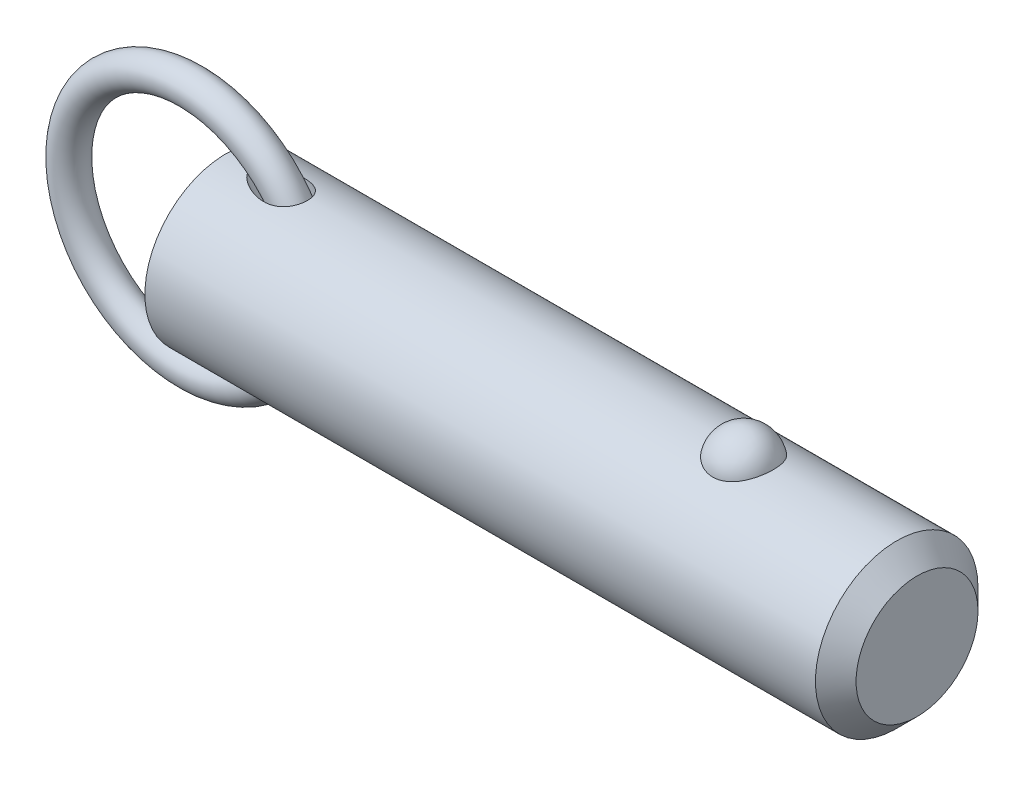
ISO-10303-21;
HEADER;
FILE_DESCRIPTION(('STEP AP214'),'2;1');
FILE_NAME('part.step','',(''),(''),'','','');
FILE_SCHEMA(('AUTOMOTIVE_DESIGN { 1 0 10303 214 1 1 1 1 }'));
ENDSEC;
DATA;
#1=APPLICATION_CONTEXT('core data for automotive mechanical design processes');
#2=APPLICATION_PROTOCOL_DEFINITION('international standard','automotive_design',2000,#1);
#3=PRODUCT_CONTEXT('',#1,'mechanical');
#4=PRODUCT('Part','Part','',(#3));
#5=PRODUCT_RELATED_PRODUCT_CATEGORY('part','',(#4));
#6=PRODUCT_DEFINITION_FORMATION('','',#4);
#7=PRODUCT_DEFINITION_CONTEXT('part definition',#1,'design');
#8=PRODUCT_DEFINITION('design','',#6,#7);
#9=PRODUCT_DEFINITION_SHAPE('','',#8);
#10=(LENGTH_UNIT() NAMED_UNIT(*) SI_UNIT(.MILLI.,.METRE.));
#11=(NAMED_UNIT(*) PLANE_ANGLE_UNIT() SI_UNIT($,.RADIAN.));
#12=(NAMED_UNIT(*) SI_UNIT($,.STERADIAN.) SOLID_ANGLE_UNIT());
#13=UNCERTAINTY_MEASURE_WITH_UNIT(LENGTH_MEASURE(1.E-05),#10,'distance_accuracy_value','');
#14=(GEOMETRIC_REPRESENTATION_CONTEXT(3) GLOBAL_UNCERTAINTY_ASSIGNED_CONTEXT((#13)) GLOBAL_UNIT_ASSIGNED_CONTEXT((#10,
#11,#12)) REPRESENTATION_CONTEXT('',''));
#15=CARTESIAN_POINT('',(0.,0.,0.));
#16=DIRECTION('',(0.,0.,1.));
#17=DIRECTION('',(1.,0.,0.));
#18=AXIS2_PLACEMENT_3D('',#15,#16,#17);
#19=CARTESIAN_POINT('',(-5.53898640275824,0.,0.));
#20=DIRECTION('',(0.,0.,1.));
#21=DIRECTION('',(1.,0.,0.));
#22=AXIS2_PLACEMENT_3D('',#19,#20,#21);
#23=TOROIDAL_SURFACE('',#22,19.05,2.54);
#24=CARTESIAN_POINT('',(16.0510135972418,0.,0.));
#25=VERTEX_POINT('',#24);
#26=VERTEX_LOOP('',#25);
#27=FACE_BOUND('',#26,.T.);
#28=ADVANCED_FACE('P0_F12',(#27),#23,.T.);
#29=CLOSED_SHELL('',(#28));
#30=MANIFOLD_SOLID_BREP('P0_B1',#29);
#31=CARTESIAN_POINT('',(0.,0.,0.));
#32=DIRECTION('',(1.,0.,0.));
#33=DIRECTION('',(0.,0.,-1.));
#34=AXIS2_PLACEMENT_3D('',#31,#32,#33);
#35=CYLINDRICAL_SURFACE('',#34,12.7);
#36=CARTESIAN_POINT('',(104.775,0.,0.));
#37=DIRECTION('',(1.,0.,0.));
#38=DIRECTION('',(0.,0.,-1.));
#39=AXIS2_PLACEMENT_3D('',#36,#37,#38);
#40=CIRCLE('',#39,12.7);
#41=CARTESIAN_POINT('',(104.775,0.,-12.7));
#42=VERTEX_POINT('',#41);
#43=EDGE_CURVE('P1_E89',#42,#42,#40,.T.);
#44=ORIENTED_EDGE('',*,*,#43,.F.);
#45=EDGE_LOOP('',(#44));
#46=FACE_BOUND('',#45,.T.);
#47=CARTESIAN_POINT('',(0.,0.,0.));
#48=DIRECTION('',(1.,0.,0.));
#49=DIRECTION('',(0.,0.,-1.));
#50=AXIS2_PLACEMENT_3D('',#47,#48,#49);
#51=CIRCLE('',#50,12.7);
#52=CARTESIAN_POINT('',(0.,0.,-12.7));
#53=VERTEX_POINT('',#52);
#54=EDGE_CURVE('P1_E52',#53,#53,#51,.T.);
#55=ORIENTED_EDGE('',*,*,#54,.T.);
#56=EDGE_LOOP('',(#55));
#57=FACE_BOUND('',#56,.T.);
#58=CARTESIAN_POINT('',(80.8600429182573,11.7500437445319,4.81938502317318));
#59=CARTESIAN_POINT('',(80.7350881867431,11.7500430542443,4.81938571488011));
#60=CARTESIAN_POINT('',(80.610144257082,11.7520975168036,4.81438658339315));
#61=CARTESIAN_POINT('',(80.3611425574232,11.760253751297,4.79442904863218));
#62=CARTESIAN_POINT('',(80.2370850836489,11.7663568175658,4.77946746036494));
#63=CARTESIAN_POINT('',(79.9909016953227,11.7824262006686,4.73971414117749));
#64=CARTESIAN_POINT('',(79.8687744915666,11.7923898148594,4.71492928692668));
#65=CARTESIAN_POINT('',(79.6271874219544,11.8158938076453,4.65571340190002));
#66=CARTESIAN_POINT('',(79.5077285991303,11.8294355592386,4.6212786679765));
#67=CARTESIAN_POINT('',(79.2725578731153,11.8596812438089,4.54309502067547));
#68=CARTESIAN_POINT('',(79.1568393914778,11.8763792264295,4.49936361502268));
#69=CARTESIAN_POINT('',(78.9296530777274,11.9124878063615,4.40287235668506));
#70=CARTESIAN_POINT('',(78.8181868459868,11.9318994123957,4.35010914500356));
#71=CARTESIAN_POINT('',(78.4912782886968,11.9934256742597,4.17881316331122));
#72=CARTESIAN_POINT('',(78.2831270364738,12.038858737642,4.04720756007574));
#73=CARTESIAN_POINT('',(77.8858509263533,12.1352173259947,3.748564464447));
#74=CARTESIAN_POINT('',(77.6974438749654,12.1862630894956,3.58061821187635));
#75=CARTESIAN_POINT('',(77.3505213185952,12.2875163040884,3.21600758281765));
#76=CARTESIAN_POINT('',(77.1920113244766,12.3377235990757,3.0193379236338));
#77=CARTESIAN_POINT('',(76.9016887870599,12.4344923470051,2.592916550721));
#78=CARTESIAN_POINT('',(76.7713762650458,12.4807925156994,2.36208286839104));
#79=CARTESIAN_POINT('',(76.5494079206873,12.5623454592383,1.88070399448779));
#80=CARTESIAN_POINT('',(76.4577554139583,12.5975972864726,1.63015711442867));
#81=CARTESIAN_POINT('',(76.3140466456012,12.6538414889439,1.1129886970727));
#82=CARTESIAN_POINT('',(76.2624990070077,12.6746503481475,0.846205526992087));
#83=CARTESIAN_POINT('',(76.2019771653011,12.699153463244,0.307085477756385));
#84=CARTESIAN_POINT('',(76.1930018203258,12.7028481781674,0.0347487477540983));
#85=CARTESIAN_POINT('',(76.2177310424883,12.6927785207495,-0.506073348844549));
#86=CARTESIAN_POINT('',(76.2511899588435,12.6791146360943,-0.774571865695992));
#87=CARTESIAN_POINT('',(76.3596877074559,12.635882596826,-1.30170246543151));
#88=CARTESIAN_POINT('',(76.4347272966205,12.606314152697,-1.5603343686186));
#89=CARTESIAN_POINT('',(76.6250000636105,12.5342328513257,-2.06083899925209));
#90=CARTESIAN_POINT('',(76.7402872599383,12.4917026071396,-2.3026886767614));
#91=CARTESIAN_POINT('',(77.0087044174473,12.3981123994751,-2.76259600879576));
#92=CARTESIAN_POINT('',(77.1618374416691,12.3470517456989,-2.98065173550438));
#93=CARTESIAN_POINT('',(77.5035077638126,12.2416045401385,-3.38786328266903));
#94=CARTESIAN_POINT('',(77.6922017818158,12.1872040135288,-3.57688418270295));
#95=CARTESIAN_POINT('',(78.1002392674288,12.0814086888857,-3.91941073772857));
#96=CARTESIAN_POINT('',(78.3195800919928,12.0300136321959,-4.07291945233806));
#97=CARTESIAN_POINT('',(78.7783753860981,11.9373542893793,-4.33691289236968));
#98=CARTESIAN_POINT('',(79.0173044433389,11.8958982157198,-4.44824125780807));
#99=CARTESIAN_POINT('',(79.5124376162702,11.8268116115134,-4.62881985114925));
#100=CARTESIAN_POINT('',(79.7686351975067,11.7991758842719,-4.69808589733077));
#101=CARTESIAN_POINT('',(80.2771640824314,11.7622209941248,-4.78983181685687));
#102=CARTESIAN_POINT('',(80.5290414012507,11.7520502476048,-4.81449025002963));
#103=CARTESIAN_POINT('',(81.0335734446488,11.7485796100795,-4.82295735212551));
#104=CARTESIAN_POINT('',(81.2862280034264,11.7552763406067,-4.80677420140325));
#105=CARTESIAN_POINT('',(81.7768341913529,11.7842584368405,-4.73525430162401));
#106=CARTESIAN_POINT('',(82.0149984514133,11.8060486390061,-4.6811606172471));
#107=CARTESIAN_POINT('',(82.4784894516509,11.8622750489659,-4.53678133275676));
#108=CARTESIAN_POINT('',(82.7038151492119,11.8967122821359,-4.44649279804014));
#109=CARTESIAN_POINT('',(83.1408018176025,11.9754603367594,-4.2298761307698));
#110=CARTESIAN_POINT('',(83.3520579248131,12.0199699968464,-4.10280539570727));
#111=CARTESIAN_POINT('',(83.7506012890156,12.1138028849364,-3.81685409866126));
#112=CARTESIAN_POINT('',(83.9378830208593,12.163127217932,-3.65796622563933));
#113=CARTESIAN_POINT('',(84.2933509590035,12.2642343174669,-3.30364864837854));
#114=CARTESIAN_POINT('',(84.4601119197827,12.3160165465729,-3.10678783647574));
#115=CARTESIAN_POINT('',(84.7595799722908,12.4142566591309,-2.68748409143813));
#116=CARTESIAN_POINT('',(84.8922809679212,12.4607135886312,-2.46503658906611));
#117=CARTESIAN_POINT('',(85.1246912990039,12.5450236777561,-1.9928951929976));
#118=CARTESIAN_POINT('',(85.223215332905,12.5825557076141,-1.74255918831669));
#119=CARTESIAN_POINT('',(85.3792277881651,12.6431720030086,-1.22773734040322));
#120=CARTESIAN_POINT('',(85.4367157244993,12.6662560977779,-0.963251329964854));
#121=CARTESIAN_POINT('',(85.5095441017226,12.6956486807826,-0.427355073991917));
#122=CARTESIAN_POINT('',(85.5248378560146,12.7019385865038,-0.155937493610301));
#123=CARTESIAN_POINT('',(85.5127794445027,12.6970201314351,0.385928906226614));
#124=CARTESIAN_POINT('',(85.4854280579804,12.6858120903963,0.656377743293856));
#125=CARTESIAN_POINT('',(85.4130609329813,12.6568455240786,1.05454017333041));
#126=CARTESIAN_POINT('',(85.3837963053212,12.6451962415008,1.18577850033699));
#127=CARTESIAN_POINT('',(85.3150228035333,12.6181819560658,1.44513808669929));
#128=CARTESIAN_POINT('',(85.2755176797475,12.6028183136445,1.57326046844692));
#129=CARTESIAN_POINT('',(85.1864397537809,12.5687547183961,1.82554978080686));
#130=CARTESIAN_POINT('',(85.1368627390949,12.5500533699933,1.9497150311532));
#131=CARTESIAN_POINT('',(85.0279211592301,12.5098093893,2.19314370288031));
#132=CARTESIAN_POINT('',(84.9685601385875,12.4882677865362,2.31240887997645));
#133=CARTESIAN_POINT('',(84.8399712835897,12.4427679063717,2.54593031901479));
#134=CARTESIAN_POINT('',(84.7706888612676,12.4187964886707,2.66015396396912));
#135=CARTESIAN_POINT('',(84.622903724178,12.3691892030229,2.88202659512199));
#136=CARTESIAN_POINT('',(84.5444044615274,12.3435539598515,2.98967802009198));
#137=CARTESIAN_POINT('',(84.3785502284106,12.2912955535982,3.19774385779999));
#138=CARTESIAN_POINT('',(84.2911918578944,12.2646720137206,3.298155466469));
#139=CARTESIAN_POINT('',(84.1081617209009,12.2111945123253,3.49095035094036));
#140=CARTESIAN_POINT('',(84.0124932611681,12.1843406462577,3.58333679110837));
#141=CARTESIAN_POINT('',(83.8136272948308,12.1312249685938,3.75922876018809));
#142=CARTESIAN_POINT('',(83.7104503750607,12.104961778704,3.84275713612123));
#143=CARTESIAN_POINT('',(83.4970133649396,12.0537284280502,4.00056406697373));
#144=CARTESIAN_POINT('',(83.3867562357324,12.028757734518,4.07484645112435));
#145=CARTESIAN_POINT('',(83.1597550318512,11.9808306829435,4.21367959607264));
#146=CARTESIAN_POINT('',(83.0430068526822,11.9578756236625,4.27822410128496));
#147=CARTESIAN_POINT('',(82.8039425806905,11.9147184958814,4.39698483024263));
#148=CARTESIAN_POINT('',(82.6816287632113,11.894515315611,4.45120522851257));
#149=CARTESIAN_POINT('',(82.422952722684,11.8561129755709,4.55255353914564));
#150=CARTESIAN_POINT('',(82.2862237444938,11.8381764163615,4.59884858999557));
#151=CARTESIAN_POINT('',(82.0086087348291,11.8069093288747,4.67853897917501));
#152=CARTESIAN_POINT('',(81.8677245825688,11.7935767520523,4.71194005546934));
#153=CARTESIAN_POINT('',(81.5830944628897,11.7720277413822,4.76552188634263));
#154=CARTESIAN_POINT('',(81.4393488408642,11.7638106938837,4.78570422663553));
#155=CARTESIAN_POINT('',(81.1504114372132,11.7528195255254,4.81263433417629));
#156=CARTESIAN_POINT('',(81.0052198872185,11.7500445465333,4.81938421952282));
#157=CARTESIAN_POINT('',(80.8600429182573,11.7500437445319,4.81938502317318));
#158=B_SPLINE_CURVE_WITH_KNOTS('',3,(#58,#59,#60,#61,#62,#63,#64,#65,#66,#67,#68,#69,#70,#71,
#72,#73,#74,#75,#76,#77,#78,#79,#80,#81,#82,#83,#84,#85,#86,#87,#88,#89,#90,#91,#92,#93,#94,#95,
#96,#97,#98,#99,#100,#101,#102,#103,#104,#105,#106,#107,#108,#109,#110,#111,#112,#113,#114,#115,
#116,#117,#118,#119,#120,#121,#122,#123,#124,#125,#126,#127,#128,#129,#130,#131,#132,#133,#134,
#135,#136,#137,#138,#139,#140,#141,#142,#143,#144,#145,#146,#147,#148,#149,#150,#151,#152,#153,
#154,#155,#156,#157),.UNSPECIFIED.,.T.,.F.,(4,2,2,2,2,2,2,2,2,2,2,2,2,2,2,2,2,2,2,2,2,2,2,2,2,2,
2,2,2,2,2,2,2,2,2,2,2,2,2,2,2,2,2,2,2,2,2,2,2,4),(0.,0.374729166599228,0.749578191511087,
1.12416526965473,1.49889629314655,1.87292776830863,2.24709865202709,2.99481328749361,
3.76399449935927,4.53331735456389,5.33683915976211,6.14042986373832,6.95405296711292,
7.76765424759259,8.57656703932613,9.38549455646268,10.1955119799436,11.0055949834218,
11.8193353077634,12.6330054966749,13.4294141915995,14.2255231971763,14.9815786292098,
15.7374826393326,16.4696948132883,17.2019663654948,17.9501979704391,18.6986017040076,
19.484470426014,20.2704797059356,21.0815215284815,21.8925729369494,22.7045213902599,
23.5164550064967,23.9209608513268,24.3253187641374,24.7298461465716,25.1342272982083,
25.54092555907,25.9474719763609,26.3541750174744,26.7607169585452,27.1661834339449,
27.5714814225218,27.9770386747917,28.3824315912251,28.8181206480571,29.2536155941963,
29.6890582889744,30.1244323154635),.UNSPECIFIED.);
#159=CARTESIAN_POINT('',(80.8600429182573,11.7500437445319,4.81938502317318));
#160=VERTEX_POINT('',#159);
#161=EDGE_CURVE('P1_E80',#160,#160,#158,.T.);
#162=ORIENTED_EDGE('',*,*,#161,.T.);
#163=EDGE_LOOP('',(#162));
#164=FACE_BOUND('',#163,.T.);
#165=CARTESIAN_POINT('',(-5.53898640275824,0.,0.));
#166=DIRECTION('',(0.796400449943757,-0.604769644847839,0.));
#167=DIRECTION('',(0.604769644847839,0.796400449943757,0.));
#168=AXIS2_PLACEMENT_3D('',#165,#166,#167);
#169=ELLIPSE('',#168,15.9467514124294,12.7);
#170=CARTESIAN_POINT('',(4.09482149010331,12.6864319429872,0.586893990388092));
#171=VERTEX_POINT('',#170);
#172=CARTESIAN_POINT('',(4.09482149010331,12.6864319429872,-0.586893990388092));
#173=VERTEX_POINT('',#172);
#174=EDGE_CURVE('P1_E47',#171,#173,#169,.F.);
#175=ORIENTED_EDGE('',*,*,#174,.T.);
#176=CARTESIAN_POINT('',(4.06153170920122,12.6905758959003,-0.48916605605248));
#177=CARTESIAN_POINT('',(4.08111374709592,12.6881366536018,-0.552489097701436));
#178=CARTESIAN_POINT('',(4.10417851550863,12.6852663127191,-0.614604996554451));
#179=CARTESIAN_POINT('',(4.1562843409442,12.6787965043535,-0.736067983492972));
#180=CARTESIAN_POINT('',(4.18531032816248,12.6751988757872,-0.795421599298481));
#181=CARTESIAN_POINT('',(4.27911159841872,12.6636052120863,-0.967590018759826));
#182=CARTESIAN_POINT('',(4.35123408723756,12.654730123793,-1.07635920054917));
#183=CARTESIAN_POINT('',(4.49106800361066,12.6376715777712,-1.25922957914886));
#184=CARTESIAN_POINT('',(4.5560106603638,12.6297947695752,-1.33556751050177));
#185=CARTESIAN_POINT('',(4.69223626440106,12.6134116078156,-1.48232741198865));
#186=CARTESIAN_POINT('',(4.7635214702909,12.6049050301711,-1.55274725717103));
#187=CARTESIAN_POINT('',(4.91163946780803,12.587417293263,-1.68868704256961));
#188=CARTESIAN_POINT('',(4.98851399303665,12.5784327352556,-1.75416062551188));
#189=CARTESIAN_POINT('',(5.14630057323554,12.560235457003,-1.88003275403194));
#190=CARTESIAN_POINT('',(5.22721398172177,12.5510226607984,-1.94042957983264));
#191=CARTESIAN_POINT('',(5.45368877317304,12.5256514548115,-2.09966332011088));
#192=CARTESIAN_POINT('',(5.60261616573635,12.5094182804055,-2.19371988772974));
#193=CARTESIAN_POINT('',(5.90795545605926,12.4774211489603,-2.36893890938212));
#194=CARTESIAN_POINT('',(6.06437232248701,12.4616575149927,-2.45009264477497));
#195=CARTESIAN_POINT('',(6.38306132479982,12.431227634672,-2.60008249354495));
#196=CARTESIAN_POINT('',(6.54533237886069,12.4165611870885,-2.66892086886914));
#197=CARTESIAN_POINT('',(6.87462618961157,12.3889351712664,-2.79435199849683));
#198=CARTESIAN_POINT('',(7.0416477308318,12.3759751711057,-2.85094785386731));
#199=CARTESIAN_POINT('',(7.38726647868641,12.3518460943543,-2.95377962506));
#200=CARTESIAN_POINT('',(7.56604577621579,12.3407843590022,-2.9994320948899));
#201=CARTESIAN_POINT('',(7.92698692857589,12.3219309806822,-3.07596683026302));
#202=CARTESIAN_POINT('',(8.10914972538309,12.314140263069,-3.1068449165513));
#203=CARTESIAN_POINT('',(8.47511457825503,12.3025918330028,-3.15226850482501));
#204=CARTESIAN_POINT('',(8.6589097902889,12.2988216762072,-3.16686440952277));
#205=CARTESIAN_POINT('',(9.02696087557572,12.2959421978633,-3.17802250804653));
#206=CARTESIAN_POINT('',(9.21121628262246,12.2968292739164,-3.17459864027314));
#207=CARTESIAN_POINT('',(9.61636263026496,12.3045198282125,-3.14471110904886));
#208=CARTESIAN_POINT('',(9.83695552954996,12.3125080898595,-3.1136323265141));
#209=CARTESIAN_POINT('',(10.1619126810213,12.3303028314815,-3.04206574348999));
#210=CARTESIAN_POINT('',(10.2692747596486,12.3372061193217,-3.01403983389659));
#211=CARTESIAN_POINT('',(10.4811758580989,12.3528538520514,-2.94925947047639));
#212=CARTESIAN_POINT('',(10.5857162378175,12.361597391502,-2.91250930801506));
#213=CARTESIAN_POINT('',(10.7921321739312,12.3808585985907,-2.82951748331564));
#214=CARTESIAN_POINT('',(10.8939665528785,12.3913944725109,-2.78317723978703));
#215=CARTESIAN_POINT('',(11.0926118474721,12.4138762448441,-2.68112002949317));
#216=CARTESIAN_POINT('',(11.1894254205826,12.4258213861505,-2.62540809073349));
#217=CARTESIAN_POINT('',(11.3768740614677,12.4507225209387,-2.50465655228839));
#218=CARTESIAN_POINT('',(11.46751150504,12.4636781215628,-2.43962056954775));
#219=CARTESIAN_POINT('',(11.641457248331,12.4901070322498,-2.30048560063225));
#220=CARTESIAN_POINT('',(11.7247669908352,12.5035802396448,-2.2263884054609));
#221=CARTESIAN_POINT('',(11.8713131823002,12.5285000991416,-2.08117367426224));
#222=CARTESIAN_POINT('',(11.9357009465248,12.5399538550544,-2.0112159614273));
#223=CARTESIAN_POINT('',(12.0576805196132,12.5624496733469,-1.86555293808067));
#224=CARTESIAN_POINT('',(12.1152732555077,12.5734917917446,-1.7898484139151));
#225=CARTESIAN_POINT('',(12.2230738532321,12.5947858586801,-1.63327883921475));
#226=CARTESIAN_POINT('',(12.2732844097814,12.6050380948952,-1.55241568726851));
#227=CARTESIAN_POINT('',(12.3658430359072,12.6243983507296,-1.38621267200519));
#228=CARTESIAN_POINT('',(12.4081916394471,12.6335064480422,-1.30087311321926));
#229=CARTESIAN_POINT('',(12.5150098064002,12.6569076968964,-1.05702619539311));
#230=CARTESIAN_POINT('',(12.5703399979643,12.6695746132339,-0.894232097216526));
#231=CARTESIAN_POINT('',(12.6526225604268,12.6886816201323,-0.561391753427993));
#232=CARTESIAN_POINT('',(12.6795825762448,12.6951233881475,-0.391347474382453));
#233=CARTESIAN_POINT('',(12.7041016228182,12.7009766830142,-0.0537636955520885));
#234=CARTESIAN_POINT('',(12.7024538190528,12.7005778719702,0.113714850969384));
#235=CARTESIAN_POINT('',(12.6717240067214,12.6932548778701,0.445979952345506));
#236=CARTESIAN_POINT('',(12.6426435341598,12.6863310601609,0.61076665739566));
#237=CARTESIAN_POINT('',(12.5579769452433,12.6667465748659,0.932429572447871));
#238=CARTESIAN_POINT('',(12.5024793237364,12.6541050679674,1.08933027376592));
#239=CARTESIAN_POINT('',(12.3665691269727,12.6244558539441,1.39146752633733));
#240=CARTESIAN_POINT('',(12.2861577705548,12.6074483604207,1.53670464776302));
#241=CARTESIAN_POINT('',(12.1018203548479,12.5706804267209,1.81319588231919));
#242=CARTESIAN_POINT('',(11.9976588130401,12.5508932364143,1.94428915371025));
#243=CARTESIAN_POINT('',(11.7695265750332,12.5107540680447,2.18776051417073));
#244=CARTESIAN_POINT('',(11.6455540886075,12.4904020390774,2.30013691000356));
#245=CARTESIAN_POINT('',(11.3759347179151,12.4502278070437,2.50870972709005));
#246=CARTESIAN_POINT('',(11.2295880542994,12.4304654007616,2.60400962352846));
#247=CARTESIAN_POINT('',(10.9239803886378,12.3941696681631,2.7716292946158));
#248=CARTESIAN_POINT('',(10.7647152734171,12.3776373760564,2.84394171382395));
#249=CARTESIAN_POINT('',(10.4192039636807,12.3473062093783,2.9730352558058));
#250=CARTESIAN_POINT('',(10.231933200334,12.3340204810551,3.02717164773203));
#251=CARTESIAN_POINT('',(9.85152982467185,12.3134301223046,3.10986173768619));
#252=CARTESIAN_POINT('',(9.65839336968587,12.3061295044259,3.13839827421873));
#253=CARTESIAN_POINT('',(9.31022514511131,12.2982822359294,3.16897517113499));
#254=CARTESIAN_POINT('',(9.15555718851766,12.2966525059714,3.1752689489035));
#255=CARTESIAN_POINT('',(8.84618945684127,12.2967963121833,3.17471335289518));
#256=CARTESIAN_POINT('',(8.69148970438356,12.2985715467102,3.16785742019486));
#257=CARTESIAN_POINT('',(8.38280471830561,12.3051648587,3.14214692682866));
#258=CARTESIAN_POINT('',(8.22882218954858,12.3099904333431,3.12326280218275));
#259=CARTESIAN_POINT('',(7.92276070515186,12.3222644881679,3.07448013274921));
#260=CARTESIAN_POINT('',(7.77068148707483,12.3297126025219,3.04458312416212));
#261=CARTESIAN_POINT('',(7.46452663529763,12.3470493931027,2.97350781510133));
#262=CARTESIAN_POINT('',(7.31052714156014,12.3570043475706,2.93201910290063));
#263=CARTESIAN_POINT('',(7.00579083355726,12.3787609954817,2.83876185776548));
#264=CARTESIAN_POINT('',(6.85505451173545,12.3905629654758,2.78699178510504));
#265=CARTESIAN_POINT('',(6.55781208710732,12.415528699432,2.6735774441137));
#266=CARTESIAN_POINT('',(6.41129783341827,12.4286895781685,2.61195394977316));
#267=CARTESIAN_POINT('',(6.12302950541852,12.4559398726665,2.47874512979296));
#268=CARTESIAN_POINT('',(5.981273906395,12.4700289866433,2.40716303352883));
#269=CARTESIAN_POINT('',(5.6707312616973,12.5020754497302,2.2355042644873));
#270=CARTESIAN_POINT('',(5.50343839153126,12.5201625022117,2.13268685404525));
#271=CARTESIAN_POINT('',(5.26147616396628,12.5471537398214,1.96522579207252));
#272=CARTESIAN_POINT('',(5.18224299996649,12.5561365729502,1.90713440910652));
#273=CARTESIAN_POINT('',(5.02746475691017,12.573912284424,1.78618989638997));
#274=CARTESIAN_POINT('',(4.95191912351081,12.5827051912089,1.72333748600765));
#275=CARTESIAN_POINT('',(4.81787163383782,12.598469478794,1.60360864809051));
#276=CARTESIAN_POINT('',(4.75865966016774,12.6054958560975,1.54753994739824));
#277=CARTESIAN_POINT('',(4.64406285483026,12.6191906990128,1.43158546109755));
#278=CARTESIAN_POINT('',(4.5886792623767,12.6258590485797,1.37169845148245));
#279=CARTESIAN_POINT('',(4.43014912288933,12.6450546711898,1.18656670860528));
#280=CARTESIAN_POINT('',(4.3337272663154,12.6568788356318,1.05507993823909));
#281=CARTESIAN_POINT('',(4.21252055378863,12.6718304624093,0.848052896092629));
#282=CARTESIAN_POINT('',(4.17660155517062,12.6762773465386,0.779100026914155));
#283=CARTESIAN_POINT('',(4.11264979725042,12.6842122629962,0.637080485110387));
#284=CARTESIAN_POINT('',(4.08466792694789,12.6876941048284,0.563990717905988));
#285=CARTESIAN_POINT('',(4.06153170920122,12.6905758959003,0.4891660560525));
#286=B_SPLINE_CURVE_WITH_KNOTS('',3,(#176,#177,#178,#179,#180,#181,#182,#183,#184,#185,#186,
#187,#188,#189,#190,#191,#192,#193,#194,#195,#196,#197,#198,#199,#200,#201,#202,#203,#204,#205,
#206,#207,#208,#209,#210,#211,#212,#213,#214,#215,#216,#217,#218,#219,#220,#221,#222,#223,#224,
#225,#226,#227,#228,#229,#230,#231,#232,#233,#234,#235,#236,#237,#238,#239,#240,#241,#242,#243,
#244,#245,#246,#247,#248,#249,#250,#251,#252,#253,#254,#255,#256,#257,#258,#259,#260,#261,#262,
#263,#264,#265,#266,#267,#268,#269,#270,#271,#272,#273,#274,#275,#276,#277,#278,#279,#280,#281,
#282,#283,#284,#285),.UNSPECIFIED.,.F.,.F.,(4,2,2,2,2,2,2,2,2,2,2,2,2,2,2,2,2,2,2,2,2,2,2,2,2,2,
2,2,2,2,2,2,2,2,2,2,2,2,2,2,2,2,2,2,2,2,2,2,2,2,2,2,2,2,4),(0.,0.198708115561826,
0.39691995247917,0.787580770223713,1.08882492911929,1.39017679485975,1.69407136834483,
1.99806847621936,2.52793143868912,3.05815092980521,3.58827293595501,4.11826050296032,
4.67218806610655,5.22627222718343,5.77863637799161,6.3305733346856,6.99657211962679,
7.32977411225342,7.66281254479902,7.99946156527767,8.33593054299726,8.67226935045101,
9.00854178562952,9.29544181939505,9.58230266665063,9.86905853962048,10.1557949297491,
10.6702338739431,11.1845341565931,11.6845985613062,12.1846349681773,12.6830079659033,
13.1813565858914,13.68487951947,14.1884479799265,14.713533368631,15.2387866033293,
15.8228373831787,16.407279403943,16.8710810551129,17.3351141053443,17.8002921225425,
18.2654052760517,18.7444169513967,19.2235004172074,19.7015868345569,20.1795185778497,
20.7699825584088,21.0658110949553,21.3615950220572,21.606957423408,21.8523988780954,
22.3397467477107,22.5729183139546,22.8075527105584),.UNSPECIFIED.);
#287=EDGE_CURVE('P1_E51',#173,#171,#286,.T.);
#288=ORIENTED_EDGE('',*,*,#287,.T.);
#289=EDGE_LOOP('',(#175,#288));
#290=FACE_BOUND('',#289,.T.);
#291=CARTESIAN_POINT('',(-5.53898640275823,0.,0.));
#292=DIRECTION('',(-0.796400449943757,-0.604769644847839,0.));
#293=DIRECTION('',(0.604769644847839,-0.796400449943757,0.));
#294=AXIS2_PLACEMENT_3D('',#291,#292,#293);
#295=ELLIPSE('',#294,15.9467514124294,12.7);
#296=CARTESIAN_POINT('',(4.09482149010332,-12.6864319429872,0.586893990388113));
#297=VERTEX_POINT('',#296);
#298=CARTESIAN_POINT('',(4.09482149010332,-12.6864319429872,-0.586893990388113));
#299=VERTEX_POINT('',#298);
#300=EDGE_CURVE('P1_E28',#297,#299,#295,.F.);
#301=ORIENTED_EDGE('',*,*,#300,.F.);
#302=CARTESIAN_POINT('',(4.06153170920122,-12.6905758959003,0.489166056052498));
#303=CARTESIAN_POINT('',(4.08111374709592,-12.6881366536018,0.552489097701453));
#304=CARTESIAN_POINT('',(4.10417851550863,-12.6852663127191,0.614604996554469));
#305=CARTESIAN_POINT('',(4.15628434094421,-12.6787965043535,0.736067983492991));
#306=CARTESIAN_POINT('',(4.18531032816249,-12.6751988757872,0.795421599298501));
#307=CARTESIAN_POINT('',(4.27911159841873,-12.6636052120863,0.967590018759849));
#308=CARTESIAN_POINT('',(4.35123408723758,-12.654730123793,1.07635920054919));
#309=CARTESIAN_POINT('',(4.49106800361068,-12.6376715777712,1.25922957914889));
#310=CARTESIAN_POINT('',(4.55601066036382,-12.6297947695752,1.3355675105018));
#311=CARTESIAN_POINT('',(4.69223626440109,-12.6134116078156,1.48232741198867));
#312=CARTESIAN_POINT('',(4.76352147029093,-12.6049050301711,1.55274725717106));
#313=CARTESIAN_POINT('',(4.91163946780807,-12.587417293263,1.68868704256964));
#314=CARTESIAN_POINT('',(4.98851399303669,-12.5784327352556,1.75416062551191));
#315=CARTESIAN_POINT('',(5.14630057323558,-12.560235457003,1.88003275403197));
#316=CARTESIAN_POINT('',(5.22721398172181,-12.5510226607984,1.94042957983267));
#317=CARTESIAN_POINT('',(5.45368877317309,-12.5256514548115,2.09966332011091));
#318=CARTESIAN_POINT('',(5.60261616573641,-12.5094182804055,2.19371988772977));
#319=CARTESIAN_POINT('',(5.90795545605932,-12.4774211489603,2.36893890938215));
#320=CARTESIAN_POINT('',(6.06437232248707,-12.4616575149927,2.450092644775));
#321=CARTESIAN_POINT('',(6.38306132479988,-12.431227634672,2.60008249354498));
#322=CARTESIAN_POINT('',(6.54533237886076,-12.4165611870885,2.66892086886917));
#323=CARTESIAN_POINT('',(6.87462618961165,-12.3889351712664,2.79435199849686));
#324=CARTESIAN_POINT('',(7.04164773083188,-12.3759751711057,2.85094785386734));
#325=CARTESIAN_POINT('',(7.38726647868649,-12.3518460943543,2.95377962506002));
#326=CARTESIAN_POINT('',(7.56604577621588,-12.3407843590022,2.99943209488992));
#327=CARTESIAN_POINT('',(7.92698692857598,-12.3219309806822,3.07596683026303));
#328=CARTESIAN_POINT('',(8.10914972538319,-12.314140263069,3.10684491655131));
#329=CARTESIAN_POINT('',(8.47511457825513,-12.3025918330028,3.15226850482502));
#330=CARTESIAN_POINT('',(8.65890979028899,-12.2988216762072,3.16686440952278));
#331=CARTESIAN_POINT('',(9.02696087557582,-12.2959421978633,3.17802250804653));
#332=CARTESIAN_POINT('',(9.21121628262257,-12.2968292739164,3.17459864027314));
#333=CARTESIAN_POINT('',(9.61636263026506,-12.3045198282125,3.14471110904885));
#334=CARTESIAN_POINT('',(9.83695552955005,-12.3125080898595,3.11363232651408));
#335=CARTESIAN_POINT('',(10.1619126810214,-12.3303028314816,3.04206574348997));
#336=CARTESIAN_POINT('',(10.2692747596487,-12.3372061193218,3.01403983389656));
#337=CARTESIAN_POINT('',(10.481175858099,-12.3528538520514,2.94925947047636));
#338=CARTESIAN_POINT('',(10.5857162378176,-12.361597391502,2.91250930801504));
#339=CARTESIAN_POINT('',(10.7921321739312,-12.3808585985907,2.82951748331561));
#340=CARTESIAN_POINT('',(10.8939665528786,-12.3913944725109,2.78317723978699));
#341=CARTESIAN_POINT('',(11.0926118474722,-12.4138762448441,2.68112002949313));
#342=CARTESIAN_POINT('',(11.1894254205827,-12.4258213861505,2.62540809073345));
#343=CARTESIAN_POINT('',(11.3768740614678,-12.4507225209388,2.50465655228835));
#344=CARTESIAN_POINT('',(11.4675115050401,-12.4636781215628,2.4396205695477));
#345=CARTESIAN_POINT('',(11.641457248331,-12.4901070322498,2.3004856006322));
#346=CARTESIAN_POINT('',(11.7247669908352,-12.5035802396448,2.22638840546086));
#347=CARTESIAN_POINT('',(11.8713131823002,-12.5285000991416,2.0811736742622));
#348=CARTESIAN_POINT('',(11.9357009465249,-12.5399538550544,2.01121596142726));
#349=CARTESIAN_POINT('',(12.0576805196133,-12.5624496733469,1.86555293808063));
#350=CARTESIAN_POINT('',(12.1152732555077,-12.5734917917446,1.78984841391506));
#351=CARTESIAN_POINT('',(12.2230738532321,-12.5947858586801,1.63327883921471));
#352=CARTESIAN_POINT('',(12.2732844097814,-12.6050380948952,1.55241568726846));
#353=CARTESIAN_POINT('',(12.3658430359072,-12.6243983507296,1.38621267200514));
#354=CARTESIAN_POINT('',(12.4081916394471,-12.6335064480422,1.30087311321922));
#355=CARTESIAN_POINT('',(12.5150098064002,-12.6569076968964,1.05702619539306));
#356=CARTESIAN_POINT('',(12.5703399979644,-12.6695746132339,0.89423209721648));
#357=CARTESIAN_POINT('',(12.6526225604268,-12.6886816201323,0.561391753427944));
#358=CARTESIAN_POINT('',(12.6795825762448,-12.6951233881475,0.391347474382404));
#359=CARTESIAN_POINT('',(12.7041016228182,-12.7009766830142,0.0537636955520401));
#360=CARTESIAN_POINT('',(12.7024538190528,-12.7005778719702,-0.113714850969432));
#361=CARTESIAN_POINT('',(12.6717240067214,-12.6932548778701,-0.445979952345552));
#362=CARTESIAN_POINT('',(12.6426435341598,-12.6863310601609,-0.610766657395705));
#363=CARTESIAN_POINT('',(12.5579769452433,-12.6667465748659,-0.932429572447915));
#364=CARTESIAN_POINT('',(12.5024793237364,-12.6541050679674,-1.08933027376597));
#365=CARTESIAN_POINT('',(12.3665691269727,-12.6244558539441,-1.39146752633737));
#366=CARTESIAN_POINT('',(12.2861577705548,-12.6074483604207,-1.53670464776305));
#367=CARTESIAN_POINT('',(12.1018203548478,-12.5706804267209,-1.81319588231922));
#368=CARTESIAN_POINT('',(11.99765881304,-12.5508932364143,-1.94428915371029));
#369=CARTESIAN_POINT('',(11.7695265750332,-12.5107540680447,-2.18776051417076));
#370=CARTESIAN_POINT('',(11.6455540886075,-12.4904020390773,-2.30013691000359));
#371=CARTESIAN_POINT('',(11.375934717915,-12.4502278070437,-2.50870972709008));
#372=CARTESIAN_POINT('',(11.2295880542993,-12.4304654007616,-2.60400962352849));
#373=CARTESIAN_POINT('',(10.9239803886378,-12.3941696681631,-2.77162929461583));
#374=CARTESIAN_POINT('',(10.764715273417,-12.3776373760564,-2.84394171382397));
#375=CARTESIAN_POINT('',(10.4192039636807,-12.3473062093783,-2.97303525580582));
#376=CARTESIAN_POINT('',(10.2319332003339,-12.3340204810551,-3.02717164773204));
#377=CARTESIAN_POINT('',(9.8515298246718,-12.3134301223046,-3.1098617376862));
#378=CARTESIAN_POINT('',(9.65839336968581,-12.3061295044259,-3.13839827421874));
#379=CARTESIAN_POINT('',(9.31022514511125,-12.2982822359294,-3.168975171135));
#380=CARTESIAN_POINT('',(9.1555571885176,-12.2966525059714,-3.1752689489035));
#381=CARTESIAN_POINT('',(8.84618945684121,-12.2967963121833,-3.17471335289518));
#382=CARTESIAN_POINT('',(8.6914897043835,-12.2985715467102,-3.16785742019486));
#383=CARTESIAN_POINT('',(8.38280471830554,-12.3051648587,-3.14214692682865));
#384=CARTESIAN_POINT('',(8.22882218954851,-12.3099904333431,-3.12326280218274));
#385=CARTESIAN_POINT('',(7.92276070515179,-12.3222644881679,-3.07448013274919));
#386=CARTESIAN_POINT('',(7.77068148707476,-12.329712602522,-3.04458312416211));
#387=CARTESIAN_POINT('',(7.46452663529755,-12.3470493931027,-2.97350781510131));
#388=CARTESIAN_POINT('',(7.31052714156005,-12.3570043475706,-2.93201910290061));
#389=CARTESIAN_POINT('',(7.00579083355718,-12.3787609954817,-2.83876185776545));
#390=CARTESIAN_POINT('',(6.85505451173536,-12.3905629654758,-2.78699178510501));
#391=CARTESIAN_POINT('',(6.55781208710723,-12.415528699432,-2.67357744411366));
#392=CARTESIAN_POINT('',(6.41129783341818,-12.4286895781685,-2.61195394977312));
#393=CARTESIAN_POINT('',(6.12302950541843,-12.4559398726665,-2.47874512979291));
#394=CARTESIAN_POINT('',(5.9812739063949,-12.4700289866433,-2.40716303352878));
#395=CARTESIAN_POINT('',(5.6707312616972,-12.5020754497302,-2.23550426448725));
#396=CARTESIAN_POINT('',(5.50343839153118,-12.5201625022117,-2.13268685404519));
#397=CARTESIAN_POINT('',(5.2614761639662,-12.5471537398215,-1.96522579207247));
#398=CARTESIAN_POINT('',(5.18224299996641,-12.5561365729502,-1.90713440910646));
#399=CARTESIAN_POINT('',(5.0274647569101,-12.573912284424,-1.78618989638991));
#400=CARTESIAN_POINT('',(4.95191912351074,-12.5827051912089,-1.7233374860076));
#401=CARTESIAN_POINT('',(4.81787163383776,-12.598469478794,-1.60360864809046));
#402=CARTESIAN_POINT('',(4.75865966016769,-12.6054958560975,-1.54753994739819));
#403=CARTESIAN_POINT('',(4.64406285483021,-12.6191906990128,-1.43158546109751));
#404=CARTESIAN_POINT('',(4.58867926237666,-12.6258590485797,-1.37169845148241));
#405=CARTESIAN_POINT('',(4.43014912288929,-12.6450546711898,-1.18656670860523));
#406=CARTESIAN_POINT('',(4.33372726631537,-12.6568788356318,-1.05507993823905));
#407=CARTESIAN_POINT('',(4.2125205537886,-12.6718304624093,-0.848052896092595));
#408=CARTESIAN_POINT('',(4.17660155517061,-12.6762773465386,-0.779100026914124));
#409=CARTESIAN_POINT('',(4.11264979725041,-12.6842122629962,-0.637080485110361));
#410=CARTESIAN_POINT('',(4.08466792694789,-12.6876941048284,-0.563990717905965));
#411=CARTESIAN_POINT('',(4.06153170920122,-12.6905758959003,-0.489166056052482));
#412=B_SPLINE_CURVE_WITH_KNOTS('',3,(#302,#303,#304,#305,#306,#307,#308,#309,#310,#311,#312,
#313,#314,#315,#316,#317,#318,#319,#320,#321,#322,#323,#324,#325,#326,#327,#328,#329,#330,#331,
#332,#333,#334,#335,#336,#337,#338,#339,#340,#341,#342,#343,#344,#345,#346,#347,#348,#349,#350,
#351,#352,#353,#354,#355,#356,#357,#358,#359,#360,#361,#362,#363,#364,#365,#366,#367,#368,#369,
#370,#371,#372,#373,#374,#375,#376,#377,#378,#379,#380,#381,#382,#383,#384,#385,#386,#387,#388,
#389,#390,#391,#392,#393,#394,#395,#396,#397,#398,#399,#400,#401,#402,#403,#404,#405,#406,#407,
#408,#409,#410,#411),.UNSPECIFIED.,.F.,.F.,(4,2,2,2,2,2,2,2,2,2,2,2,2,2,2,2,2,2,2,2,2,2,2,2,2,2,
2,2,2,2,2,2,2,2,2,2,2,2,2,2,2,2,2,2,2,2,2,2,2,2,2,2,2,2,4),(0.,0.198708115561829,
0.396919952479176,0.787580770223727,1.08882492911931,1.39017679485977,1.69407136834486,
1.9980684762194,2.52793143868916,3.05815092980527,3.58827293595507,4.11826050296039,
4.67218806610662,5.22627222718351,5.77863637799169,6.33057333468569,6.99657211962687,
7.32977411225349,7.66281254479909,7.99946156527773,8.33593054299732,8.67226935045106,
9.00854178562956,9.29544181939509,9.58230266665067,9.86905853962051,10.1557949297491,
10.6702338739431,11.1845341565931,11.6845985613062,12.1846349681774,12.6830079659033,
13.1813565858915,13.68487951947,14.1884479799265,14.7135333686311,15.2387866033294,
15.8228373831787,16.4072794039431,16.871081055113,17.3351141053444,17.8002921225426,
18.2654052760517,18.7444169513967,19.2235004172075,19.701586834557,20.1795185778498,
20.7699825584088,21.0658110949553,21.3615950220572,21.606957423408,21.8523988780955,
22.3397467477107,22.5729183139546,22.8075527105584),.UNSPECIFIED.);
#413=EDGE_CURVE('P1_E10',#297,#299,#412,.T.);
#414=ORIENTED_EDGE('',*,*,#413,.T.);
#415=EDGE_LOOP('',(#301,#414));
#416=FACE_BOUND('',#415,.T.);
#417=ADVANCED_FACE('P1_F15',(#46,#57,#164,#290,#416),#35,.T.);
#418=CARTESIAN_POINT('',(0.,0.,0.));
#419=DIRECTION('',(-1.,0.,0.));
#420=DIRECTION('',(0.,0.,1.));
#421=AXIS2_PLACEMENT_3D('',#418,#419,#420);
#422=PLANE('',#421);
#423=ORIENTED_EDGE('',*,*,#54,.F.);
#424=EDGE_LOOP('',(#423));
#425=FACE_BOUND('',#424,.T.);
#426=ADVANCED_FACE('P1_F17',(#425),#422,.T.);
#427=CARTESIAN_POINT('',(107.95,0.,0.));
#428=DIRECTION('',(-1.,0.,0.));
#429=DIRECTION('',(0.,0.,1.));
#430=AXIS2_PLACEMENT_3D('',#427,#428,#429);
#431=CONICAL_SURFACE('',#430,9.52500000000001,0.785398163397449);
#432=ORIENTED_EDGE('',*,*,#43,.T.);
#433=EDGE_LOOP('',(#432));
#434=FACE_BOUND('',#433,.T.);
#435=CARTESIAN_POINT('',(107.95,0.,0.));
#436=DIRECTION('',(1.,0.,0.));
#437=DIRECTION('',(0.,0.,-1.));
#438=AXIS2_PLACEMENT_3D('',#435,#436,#437);
#439=CIRCLE('',#438,9.52500000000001);
#440=CARTESIAN_POINT('',(107.95,0.,-9.52500000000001));
#441=VERTEX_POINT('',#440);
#442=EDGE_CURVE('P1_E86',#441,#441,#439,.T.);
#443=ORIENTED_EDGE('',*,*,#442,.F.);
#444=EDGE_LOOP('',(#443));
#445=FACE_BOUND('',#444,.T.);
#446=ADVANCED_FACE('P1_F105',(#434,#445),#431,.T.);
#447=CARTESIAN_POINT('',(107.95,9.52500000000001,0.));
#448=DIRECTION('',(1.,0.,0.));
#449=DIRECTION('',(0.,0.,-1.));
#450=AXIS2_PLACEMENT_3D('',#447,#448,#449);
#451=PLANE('',#450);
#452=ORIENTED_EDGE('',*,*,#442,.T.);
#453=EDGE_LOOP('',(#452));
#454=FACE_BOUND('',#453,.T.);
#455=ADVANCED_FACE('P1_F78',(#454),#451,.T.);
#456=CARTESIAN_POINT('',(80.8600429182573,11.43,0.));
#457=DIRECTION('',(-1.,0.,0.));
#458=DIRECTION('',(0.,-1.,0.));
#459=AXIS2_PLACEMENT_3D('',#456,#457,#458);
#460=SPHERICAL_SURFACE('',#459,4.83);
#461=ORIENTED_EDGE('',*,*,#161,.F.);
#462=EDGE_LOOP('',(#461));
#463=FACE_BOUND('',#462,.T.);
#464=ADVANCED_FACE('P1_F71',(#463),#460,.T.);
#465=CARTESIAN_POINT('',(-5.53898640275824,0.,0.));
#466=DIRECTION('',(0.,0.,1.));
#467=DIRECTION('',(1.,0.,0.));
#468=AXIS2_PLACEMENT_3D('',#465,#466,#467);
#469=TOROIDAL_SURFACE('',#468,19.05,3.175);
#470=CARTESIAN_POINT('',(5.98187533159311,-15.1714285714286,0.));
#471=DIRECTION('',(-0.796400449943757,-0.604769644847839,0.));
#472=DIRECTION('',(0.604769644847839,-0.796400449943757,0.));
#473=AXIS2_PLACEMENT_3D('',#470,#471,#472);
#474=CIRCLE('',#473,3.175);
#475=EDGE_CURVE('P1_E34',#297,#299,#474,.T.);
#476=ORIENTED_EDGE('',*,*,#475,.T.);
#477=ORIENTED_EDGE('',*,*,#413,.F.);
#478=EDGE_LOOP('',(#476,#477));
#479=FACE_BOUND('',#478,.T.);
#480=CARTESIAN_POINT('',(5.9818753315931,15.1714285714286,0.));
#481=DIRECTION('',(0.796400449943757,-0.604769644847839,0.));
#482=DIRECTION('',(0.604769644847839,0.796400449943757,0.));
#483=AXIS2_PLACEMENT_3D('',#480,#481,#482);
#484=CIRCLE('',#483,3.175);
#485=EDGE_CURVE('P1_E41',#171,#173,#484,.T.);
#486=ORIENTED_EDGE('',*,*,#485,.F.);
#487=ORIENTED_EDGE('',*,*,#287,.F.);
#488=EDGE_LOOP('',(#486,#487));
#489=FACE_BOUND('',#488,.T.);
#490=ADVANCED_FACE('P1_F55',(#479,#489),#469,.F.);
#491=CARTESIAN_POINT('',(5.98187533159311,-15.1714285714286,0.));
#492=DIRECTION('',(-0.796400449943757,-0.604769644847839,0.));
#493=DIRECTION('',(0.604769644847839,-0.796400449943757,0.));
#494=AXIS2_PLACEMENT_3D('',#491,#492,#493);
#495=PLANE('',#494);
#496=ORIENTED_EDGE('',*,*,#300,.T.);
#497=ORIENTED_EDGE('',*,*,#475,.F.);
#498=EDGE_LOOP('',(#496,#497));
#499=FACE_BOUND('',#498,.T.);
#500=ADVANCED_FACE('P1_F70',(#499),#495,.F.);
#501=CARTESIAN_POINT('',(5.9818753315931,15.1714285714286,0.));
#502=DIRECTION('',(0.796400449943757,-0.604769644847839,0.));
#503=DIRECTION('',(0.604769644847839,0.796400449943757,0.));
#504=AXIS2_PLACEMENT_3D('',#501,#502,#503);
#505=PLANE('',#504);
#506=ORIENTED_EDGE('',*,*,#485,.T.);
#507=ORIENTED_EDGE('',*,*,#174,.F.);
#508=EDGE_LOOP('',(#506,#507));
#509=FACE_BOUND('',#508,.T.);
#510=ADVANCED_FACE('P1_F48',(#509),#505,.T.);
#511=CLOSED_SHELL('',(#417,#426,#446,#455,#464,#490,#500,#510));
#512=MANIFOLD_SOLID_BREP('P1_B1',#511);
#513=ADVANCED_BREP_SHAPE_REPRESENTATION('',(#18,#30,#512),#14);
#514=SHAPE_DEFINITION_REPRESENTATION(#9,#513);
ENDSEC;
END-ISO-10303-21;
